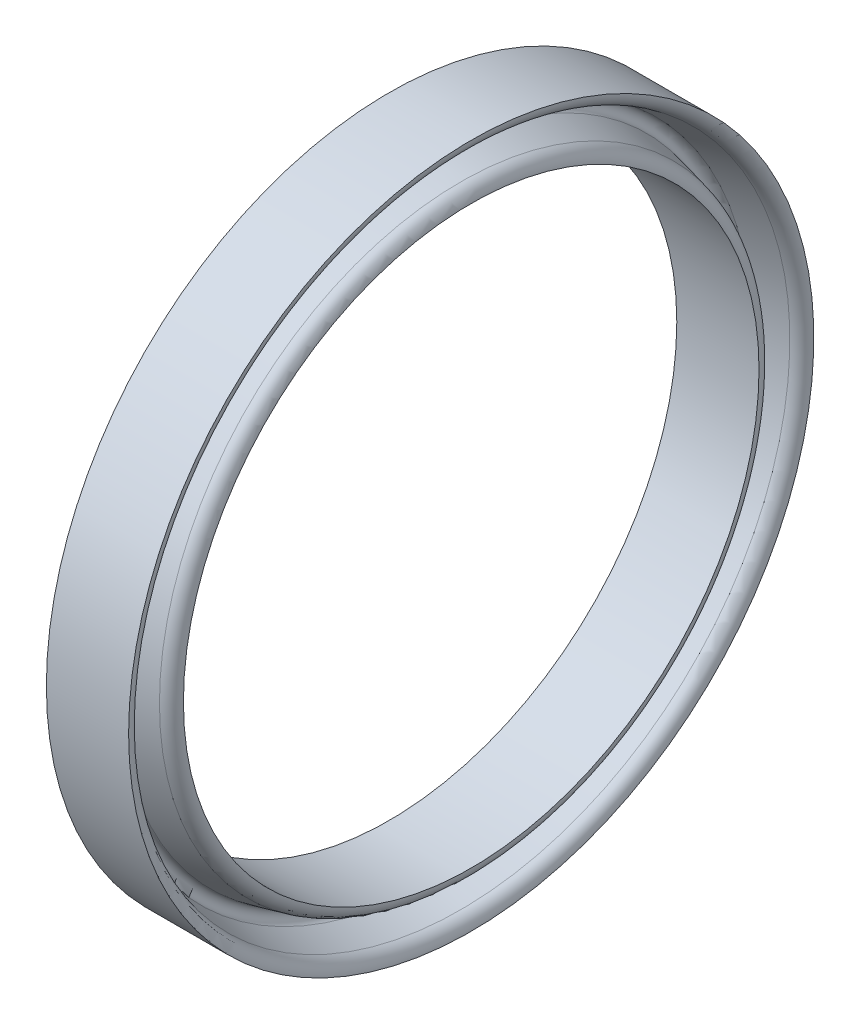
ISO-10303-21;
HEADER;
FILE_DESCRIPTION(('STEP AP214'),'2;1');
FILE_NAME('part.step','',(''),(''),'','','');
FILE_SCHEMA(('AUTOMOTIVE_DESIGN { 1 0 10303 214 1 1 1 1 }'));
ENDSEC;
DATA;
#1=APPLICATION_CONTEXT('core data for automotive mechanical design processes');
#2=APPLICATION_PROTOCOL_DEFINITION('international standard','automotive_design',2000,#1);
#3=PRODUCT_CONTEXT('',#1,'mechanical');
#4=PRODUCT('Part','Part','',(#3));
#5=PRODUCT_RELATED_PRODUCT_CATEGORY('part','',(#4));
#6=PRODUCT_DEFINITION_FORMATION('','',#4);
#7=PRODUCT_DEFINITION_CONTEXT('part definition',#1,'design');
#8=PRODUCT_DEFINITION('design','',#6,#7);
#9=PRODUCT_DEFINITION_SHAPE('','',#8);
#10=(LENGTH_UNIT() NAMED_UNIT(*) SI_UNIT(.MILLI.,.METRE.));
#11=(NAMED_UNIT(*) PLANE_ANGLE_UNIT() SI_UNIT($,.RADIAN.));
#12=(NAMED_UNIT(*) SI_UNIT($,.STERADIAN.) SOLID_ANGLE_UNIT());
#13=UNCERTAINTY_MEASURE_WITH_UNIT(LENGTH_MEASURE(1.E-05),#10,'distance_accuracy_value','');
#14=(GEOMETRIC_REPRESENTATION_CONTEXT(3) GLOBAL_UNCERTAINTY_ASSIGNED_CONTEXT((#13)) GLOBAL_UNIT_ASSIGNED_CONTEXT((#10,
#11,#12)) REPRESENTATION_CONTEXT('',''));
#15=CARTESIAN_POINT('',(0.,0.,0.));
#16=DIRECTION('',(0.,0.,1.));
#17=DIRECTION('',(1.,0.,0.));
#18=AXIS2_PLACEMENT_3D('',#15,#16,#17);
#19=CARTESIAN_POINT('',(0.,25.,0.));
#20=DIRECTION('',(1.,0.,0.));
#21=DIRECTION('',(0.,0.,-1.));
#22=AXIS2_PLACEMENT_3D('',#19,#20,#21);
#23=PLANE('',#22);
#24=CARTESIAN_POINT('',(0.,0.,0.));
#25=DIRECTION('',(-1.,0.,0.));
#26=DIRECTION('',(0.,0.,1.));
#27=AXIS2_PLACEMENT_3D('',#24,#25,#26);
#28=CIRCLE('',#27,21.);
#29=CARTESIAN_POINT('',(0.,0.,21.));
#30=VERTEX_POINT('',#29);
#31=EDGE_CURVE('E63',#30,#30,#28,.T.);
#32=ORIENTED_EDGE('',*,*,#31,.F.);
#33=EDGE_LOOP('',(#32));
#34=FACE_BOUND('',#33,.T.);
#35=CARTESIAN_POINT('',(0.,0.,0.));
#36=DIRECTION('',(-1.,0.,0.));
#37=DIRECTION('',(0.,0.,1.));
#38=AXIS2_PLACEMENT_3D('',#35,#36,#37);
#39=CIRCLE('',#38,25.);
#40=CARTESIAN_POINT('',(0.,0.,25.));
#41=VERTEX_POINT('',#40);
#42=EDGE_CURVE('E10',#41,#41,#39,.T.);
#43=ORIENTED_EDGE('',*,*,#42,.T.);
#44=EDGE_LOOP('',(#43));
#45=FACE_BOUND('',#44,.T.);
#46=ADVANCED_FACE('F33',(#34,#45),#23,.F.);
#47=CARTESIAN_POINT('',(0.,0.,0.));
#48=DIRECTION('',(-1.,0.,0.));
#49=DIRECTION('',(0.,0.,1.));
#50=AXIS2_PLACEMENT_3D('',#47,#48,#49);
#51=CYLINDRICAL_SURFACE('',#50,25.);
#52=ORIENTED_EDGE('',*,*,#42,.F.);
#53=EDGE_LOOP('',(#52));
#54=FACE_BOUND('',#53,.T.);
#55=CARTESIAN_POINT('',(6.,0.,0.));
#56=DIRECTION('',(-1.,0.,0.));
#57=DIRECTION('',(0.,0.,1.));
#58=AXIS2_PLACEMENT_3D('',#55,#56,#57);
#59=CIRCLE('',#58,25.);
#60=CARTESIAN_POINT('',(6.,0.,25.));
#61=VERTEX_POINT('',#60);
#62=EDGE_CURVE('E39',#61,#61,#59,.T.);
#63=ORIENTED_EDGE('',*,*,#62,.T.);
#64=EDGE_LOOP('',(#63));
#65=FACE_BOUND('',#64,.T.);
#66=ADVANCED_FACE('F70',(#54,#65),#51,.T.);
#67=CARTESIAN_POINT('',(5.,0.,0.));
#68=DIRECTION('',(-1.,0.,0.));
#69=DIRECTION('',(0.,0.,1.));
#70=AXIS2_PLACEMENT_3D('',#67,#68,#69);
#71=TOROIDAL_SURFACE('',#70,25.,1.);
#72=ORIENTED_EDGE('',*,*,#62,.F.);
#73=EDGE_LOOP('',(#72));
#74=FACE_BOUND('',#73,.T.);
#75=CARTESIAN_POINT('',(5.22447894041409,0.,0.));
#76=DIRECTION('',(-1.,0.,0.));
#77=DIRECTION('',(0.,0.,1.));
#78=AXIS2_PLACEMENT_3D('',#75,#76,#77);
#79=CIRCLE('',#78,24.0255210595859);
#80=CARTESIAN_POINT('',(5.22447894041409,0.,24.0255210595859));
#81=VERTEX_POINT('',#80);
#82=EDGE_CURVE('E44',#81,#81,#79,.T.);
#83=ORIENTED_EDGE('',*,*,#82,.T.);
#84=EDGE_LOOP('',(#83));
#85=FACE_BOUND('',#84,.T.);
#86=ADVANCED_FACE('F74',(#74,#85),#71,.T.);
#87=CARTESIAN_POINT('',(2.88776052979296,0.,0.));
#88=DIRECTION('',(1.,0.,0.));
#89=DIRECTION('',(0.,0.,-1.));
#90=AXIS2_PLACEMENT_3D('',#87,#88,#89);
#91=CONICAL_SURFACE('',#90,23.487239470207,0.226408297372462);
#92=ORIENTED_EDGE('',*,*,#82,.F.);
#93=EDGE_LOOP('',(#92));
#94=FACE_BOUND('',#93,.T.);
#95=CARTESIAN_POINT('',(2.88776052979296,0.,0.));
#96=DIRECTION('',(-1.,0.,0.));
#97=DIRECTION('',(0.,0.,1.));
#98=AXIS2_PLACEMENT_3D('',#95,#96,#97);
#99=CIRCLE('',#98,23.487239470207);
#100=CARTESIAN_POINT('',(2.88776052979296,0.,23.487239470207));
#101=VERTEX_POINT('',#100);
#102=EDGE_CURVE('E49',#101,#101,#99,.T.);
#103=ORIENTED_EDGE('',*,*,#102,.T.);
#104=EDGE_LOOP('',(#103));
#105=FACE_BOUND('',#104,.T.);
#106=ADVANCED_FACE('F79',(#94,#105),#91,.F.);
#107=CARTESIAN_POINT('',(3.,0.,0.));
#108=DIRECTION('',(-1.,0.,0.));
#109=DIRECTION('',(0.,0.,1.));
#110=AXIS2_PLACEMENT_3D('',#107,#108,#109);
#111=TOROIDAL_SURFACE('',#110,23.,0.499999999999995);
#112=ORIENTED_EDGE('',*,*,#102,.F.);
#113=EDGE_LOOP('',(#112));
#114=FACE_BOUND('',#113,.T.);
#115=CARTESIAN_POINT('',(2.88776052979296,0.,0.));
#116=DIRECTION('',(-1.,0.,0.));
#117=DIRECTION('',(0.,0.,1.));
#118=AXIS2_PLACEMENT_3D('',#115,#116,#117);
#119=CIRCLE('',#118,22.512760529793);
#120=CARTESIAN_POINT('',(2.88776052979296,0.,22.512760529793));
#121=VERTEX_POINT('',#120);
#122=EDGE_CURVE('E54',#121,#121,#119,.T.);
#123=ORIENTED_EDGE('',*,*,#122,.T.);
#124=EDGE_LOOP('',(#123));
#125=FACE_BOUND('',#124,.T.);
#126=ADVANCED_FACE('F85',(#114,#125),#111,.F.);
#127=CARTESIAN_POINT('',(5.22447894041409,0.,0.));
#128=DIRECTION('',(-1.,0.,0.));
#129=DIRECTION('',(0.,0.,1.));
#130=AXIS2_PLACEMENT_3D('',#127,#128,#129);
#131=CONICAL_SURFACE('',#130,21.9744789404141,0.226408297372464);
#132=ORIENTED_EDGE('',*,*,#122,.F.);
#133=EDGE_LOOP('',(#132));
#134=FACE_BOUND('',#133,.T.);
#135=CARTESIAN_POINT('',(5.22447894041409,0.,0.));
#136=DIRECTION('',(-1.,0.,0.));
#137=DIRECTION('',(0.,0.,1.));
#138=AXIS2_PLACEMENT_3D('',#135,#136,#137);
#139=CIRCLE('',#138,21.9744789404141);
#140=CARTESIAN_POINT('',(5.22447894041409,0.,21.9744789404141));
#141=VERTEX_POINT('',#140);
#142=EDGE_CURVE('E57',#141,#141,#139,.T.);
#143=ORIENTED_EDGE('',*,*,#142,.T.);
#144=EDGE_LOOP('',(#143));
#145=FACE_BOUND('',#144,.T.);
#146=ADVANCED_FACE('F89',(#134,#145),#131,.T.);
#147=CARTESIAN_POINT('',(5.,0.,0.));
#148=DIRECTION('',(-1.,0.,0.));
#149=DIRECTION('',(0.,0.,1.));
#150=AXIS2_PLACEMENT_3D('',#147,#148,#149);
#151=TOROIDAL_SURFACE('',#150,21.,1.);
#152=ORIENTED_EDGE('',*,*,#142,.F.);
#153=EDGE_LOOP('',(#152));
#154=FACE_BOUND('',#153,.T.);
#155=CARTESIAN_POINT('',(6.,0.,0.));
#156=DIRECTION('',(-1.,0.,0.));
#157=DIRECTION('',(0.,0.,1.));
#158=AXIS2_PLACEMENT_3D('',#155,#156,#157);
#159=CIRCLE('',#158,21.);
#160=CARTESIAN_POINT('',(6.,0.,21.));
#161=VERTEX_POINT('',#160);
#162=EDGE_CURVE('E60',#161,#161,#159,.T.);
#163=ORIENTED_EDGE('',*,*,#162,.T.);
#164=EDGE_LOOP('',(#163));
#165=FACE_BOUND('',#164,.T.);
#166=ADVANCED_FACE('F93',(#154,#165),#151,.T.);
#167=CARTESIAN_POINT('',(0.,0.,0.));
#168=DIRECTION('',(-1.,0.,0.));
#169=DIRECTION('',(0.,0.,1.));
#170=AXIS2_PLACEMENT_3D('',#167,#168,#169);
#171=CYLINDRICAL_SURFACE('',#170,21.);
#172=ORIENTED_EDGE('',*,*,#162,.F.);
#173=EDGE_LOOP('',(#172));
#174=FACE_BOUND('',#173,.T.);
#175=ORIENTED_EDGE('',*,*,#31,.T.);
#176=EDGE_LOOP('',(#175));
#177=FACE_BOUND('',#176,.T.);
#178=ADVANCED_FACE('F67',(#174,#177),#171,.F.);
#179=CLOSED_SHELL('',(#46,#66,#86,#106,#126,#146,#166,#178));
#180=MANIFOLD_SOLID_BREP('B2',#179);
#181=ADVANCED_BREP_SHAPE_REPRESENTATION('',(#18,#180),#14);
#182=SHAPE_DEFINITION_REPRESENTATION(#9,#181);
ENDSEC;
END-ISO-10303-21;
